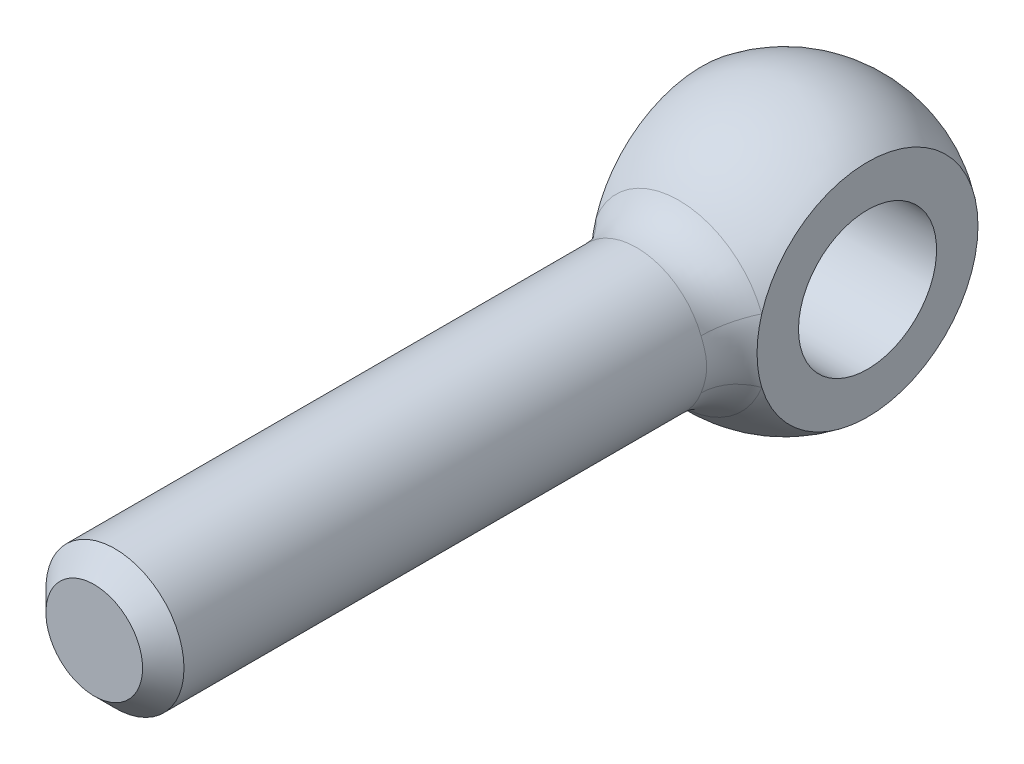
ISO-10303-21;
HEADER;
FILE_DESCRIPTION(('STEP AP214'),'2;1');
FILE_NAME('part.step','',(''),(''),'','','');
FILE_SCHEMA(('AUTOMOTIVE_DESIGN { 1 0 10303 214 1 1 1 1 }'));
ENDSEC;
DATA;
#1=APPLICATION_CONTEXT('core data for automotive mechanical design processes');
#2=APPLICATION_PROTOCOL_DEFINITION('international standard','automotive_design',2000,#1);
#3=PRODUCT_CONTEXT('',#1,'mechanical');
#4=PRODUCT('Part','Part','',(#3));
#5=PRODUCT_RELATED_PRODUCT_CATEGORY('part','',(#4));
#6=PRODUCT_DEFINITION_FORMATION('','',#4);
#7=PRODUCT_DEFINITION_CONTEXT('part definition',#1,'design');
#8=PRODUCT_DEFINITION('design','',#6,#7);
#9=PRODUCT_DEFINITION_SHAPE('','',#8);
#10=(LENGTH_UNIT() NAMED_UNIT(*) SI_UNIT(.MILLI.,.METRE.));
#11=(NAMED_UNIT(*) PLANE_ANGLE_UNIT() SI_UNIT($,.RADIAN.));
#12=(NAMED_UNIT(*) SI_UNIT($,.STERADIAN.) SOLID_ANGLE_UNIT());
#13=UNCERTAINTY_MEASURE_WITH_UNIT(LENGTH_MEASURE(1.E-05),#10,'distance_accuracy_value','');
#14=(GEOMETRIC_REPRESENTATION_CONTEXT(3) GLOBAL_UNCERTAINTY_ASSIGNED_CONTEXT((#13)) GLOBAL_UNIT_ASSIGNED_CONTEXT((#10,
#11,#12)) REPRESENTATION_CONTEXT('',''));
#15=CARTESIAN_POINT('',(0.,0.,0.));
#16=DIRECTION('',(0.,0.,1.));
#17=DIRECTION('',(1.,0.,0.));
#18=AXIS2_PLACEMENT_3D('',#15,#16,#17);
#19=CARTESIAN_POINT('',(0.,0.,0.));
#20=DIRECTION('',(-1.,0.,0.));
#21=DIRECTION('',(0.,0.,-1.));
#22=AXIS2_PLACEMENT_3D('',#19,#20,#21);
#23=SPHERICAL_SURFACE('',#22,10.);
#24=CARTESIAN_POINT('',(6.,0.,0.));
#25=DIRECTION('',(1.,0.,0.));
#26=DIRECTION('',(0.,0.,1.));
#27=AXIS2_PLACEMENT_3D('',#24,#25,#26);
#28=CIRCLE('',#27,8.);
#29=CARTESIAN_POINT('',(6.,2.30792777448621,7.65986092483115));
#30=VERTEX_POINT('',#29);
#31=CARTESIAN_POINT('',(6.,-2.30792777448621,7.65986092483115));
#32=VERTEX_POINT('',#31);
#33=EDGE_CURVE('E64',#30,#32,#28,.F.);
#34=ORIENTED_EDGE('',*,*,#33,.T.);
#35=CARTESIAN_POINT('',(0.,0.,7.65986092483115));
#36=DIRECTION('',(0.,0.,-1.));
#37=DIRECTION('',(-1.,0.,0.));
#38=AXIS2_PLACEMENT_3D('',#35,#36,#37);
#39=CIRCLE('',#38,6.42857142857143);
#40=CARTESIAN_POINT('',(-6.,-2.30792777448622,7.65986092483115));
#41=VERTEX_POINT('',#40);
#42=EDGE_CURVE('E72',#32,#41,#39,.T.);
#43=ORIENTED_EDGE('',*,*,#42,.T.);
#44=CARTESIAN_POINT('',(-6.,0.,0.));
#45=DIRECTION('',(1.,0.,0.));
#46=DIRECTION('',(0.,0.,1.));
#47=AXIS2_PLACEMENT_3D('',#44,#45,#46);
#48=CIRCLE('',#47,8.);
#49=CARTESIAN_POINT('',(-6.,2.30792777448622,7.65986092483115));
#50=VERTEX_POINT('',#49);
#51=EDGE_CURVE('E60',#50,#41,#48,.F.);
#52=ORIENTED_EDGE('',*,*,#51,.F.);
#53=CARTESIAN_POINT('',(0.,0.,7.65986092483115));
#54=DIRECTION('',(0.,0.,-1.));
#55=DIRECTION('',(-1.,0.,0.));
#56=AXIS2_PLACEMENT_3D('',#53,#54,#55);
#57=CIRCLE('',#56,6.42857142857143);
#58=EDGE_CURVE('E69',#50,#30,#57,.T.);
#59=ORIENTED_EDGE('',*,*,#58,.T.);
#60=EDGE_LOOP('',(#34,#43,#52,#59));
#61=FACE_BOUND('',#60,.T.);
#62=ADVANCED_FACE('F14',(#61),#23,.T.);
#63=CARTESIAN_POINT('',(0.,0.,-10.));
#64=DIRECTION('',(0.,0.,-1.));
#65=DIRECTION('',(1.,0.,0.));
#66=AXIS2_PLACEMENT_3D('',#63,#64,#65);
#67=CYLINDRICAL_SURFACE('',#66,5.);
#68=CARTESIAN_POINT('',(6.,3.2267323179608,7.3203960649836));
#69=CARTESIAN_POINT('',(4.3927793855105,2.40032191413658,8.4981017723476));
#70=CARTESIAN_POINT('',(4.26719928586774,2.60595668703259,10.6417078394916));
#71=CARTESIAN_POINT('',(6.,3.15637994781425,7.35140196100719));
#72=CARTESIAN_POINT('',(4.41396770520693,2.35868794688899,8.53415924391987));
#73=CARTESIAN_POINT('',(4.30636952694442,2.54182050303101,10.6569167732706));
#74=CARTESIAN_POINT('',(6.,3.0845678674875,7.38184900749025));
#75=CARTESIAN_POINT('',(4.43598568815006,2.31489371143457,8.5688842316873));
#76=CARTESIAN_POINT('',(4.34415743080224,2.47668749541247,10.6696741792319));
#77=CARTESIAN_POINT('',(6.,2.93788308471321,7.44144632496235));
#78=CARTESIAN_POINT('',(4.48100668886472,2.22296783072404,8.63529633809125));
#79=CARTESIAN_POINT('',(4.41682149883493,2.34464512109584,10.6908098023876));
#80=CARTESIAN_POINT('',(6.,2.86301195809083,7.4705972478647));
#81=CARTESIAN_POINT('',(4.50400416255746,2.1748602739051,8.6669999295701));
#82=CARTESIAN_POINT('',(4.45169913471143,2.27773667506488,10.699190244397));
#83=CARTESIAN_POINT('',(6.,2.63359256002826,7.55584558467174));
#84=CARTESIAN_POINT('',(4.5734661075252,2.02411950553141,8.75712422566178));
#85=CARTESIAN_POINT('',(4.55175884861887,2.07466593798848,10.7185614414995));
#86=CARTESIAN_POINT('',(6.,2.47414356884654,7.60978095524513));
#87=CARTESIAN_POINT('',(4.62076994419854,1.91438028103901,8.8111571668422));
#88=CARTESIAN_POINT('',(4.61242106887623,1.9360709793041,10.7238012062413));
#89=CARTESIAN_POINT('',(6.,2.15560728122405,7.70575431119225));
#90=CARTESIAN_POINT('',(4.70836207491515,1.68665244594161,8.90207343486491));
#91=CARTESIAN_POINT('',(4.71637744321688,1.66582754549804,10.7238090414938));
#92=CARTESIAN_POINT('',(6.,1.99760407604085,7.74840995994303));
#93=CARTESIAN_POINT('',(4.7489352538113,1.57023745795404,8.94011459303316));
#94=CARTESIAN_POINT('',(4.76069958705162,1.53456694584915,10.7194159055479));
#95=CARTESIAN_POINT('',(6.,1.67034421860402,7.82548342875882));
#96=CARTESIAN_POINT('',(4.82366839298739,1.32353889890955,9.00539080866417));
#97=CARTESIAN_POINT('',(4.83830988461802,1.26882691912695,10.7060668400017));
#98=CARTESIAN_POINT('',(6.,1.50108215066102,7.85989724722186));
#99=CARTESIAN_POINT('',(4.85792118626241,1.19318069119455,9.03274138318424));
#100=CARTESIAN_POINT('',(4.87159268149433,1.13434596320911,10.6971087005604));
#101=CARTESIAN_POINT('',(6.,1.15262565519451,7.91850047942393));
#102=CARTESIAN_POINT('',(4.91671483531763,0.921194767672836,9.07731285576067));
#103=CARTESIAN_POINT('',(4.92691418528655,0.862968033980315,10.6789999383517));
#104=CARTESIAN_POINT('',(6.,0.97342214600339,7.94268036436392));
#105=CARTESIAN_POINT('',(4.94135412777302,0.779366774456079,9.09462093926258));
#106=CARTESIAN_POINT('',(4.94894241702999,0.726068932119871,10.6698491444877));
#107=CARTESIAN_POINT('',(6.,0.608286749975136,7.97894634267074));
#108=CARTESIAN_POINT('',(4.97835060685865,0.488614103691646,9.11990305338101));
#109=CARTESIAN_POINT('',(4.98155564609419,0.450879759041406,10.6552429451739));
#110=CARTESIAN_POINT('',(6.,0.42235660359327,7.9910355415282));
#111=CARTESIAN_POINT('',(4.99079415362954,0.339389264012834,9.12793953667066));
#112=CARTESIAN_POINT('',(4.99214358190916,0.312590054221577,10.6497865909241));
#113=CARTESIAN_POINT('',(6.,0.0470401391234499,8.0020775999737));
#114=CARTESIAN_POINT('',(5.00212876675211,0.037959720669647,9.13527953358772));
#115=CARTESIAN_POINT('',(5.0018265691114,0.0346295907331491,10.6448278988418));
#116=CARTESIAN_POINT('',(6.,-0.142361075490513,8.0009406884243));
#117=CARTESIAN_POINT('',(5.00095572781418,-0.114635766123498,9.13454178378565));
#118=CARTESIAN_POINT('',(5.00084307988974,-0.105044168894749,10.6453662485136));
#119=CARTESIAN_POINT('',(6.,-0.51810128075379,7.98542192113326));
#120=CARTESIAN_POINT('',(4.98503390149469,-0.416175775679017,9.12417872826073));
#121=CARTESIAN_POINT('',(4.98720206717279,-0.383785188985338,10.652268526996));
#122=CARTESIAN_POINT('',(6.,-0.704439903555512,7.97103848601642));
#123=CARTESIAN_POINT('',(4.9702437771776,-0.565490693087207,9.11452643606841));
#124=CARTESIAN_POINT('',(4.97454315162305,-0.522852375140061,10.6586331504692));
#125=CARTESIAN_POINT('',(6.,-1.06953275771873,7.93031431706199));
#126=CARTESIAN_POINT('',(4.92878330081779,-0.855453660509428,9.08576459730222));
#127=CARTESIAN_POINT('',(4.93766171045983,-0.799340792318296,10.6744961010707));
#128=CARTESIAN_POINT('',(6.,-1.24828908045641,7.9039769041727));
#129=CARTESIAN_POINT('',(4.90202436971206,-0.996394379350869,9.06658927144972));
#130=CARTESIAN_POINT('',(4.91344239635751,-0.936762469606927,10.6839935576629));
#131=CARTESIAN_POINT('',(6.,-1.59553264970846,7.84126612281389));
#132=CARTESIAN_POINT('',(4.83940307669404,-1.26604567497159,9.01799514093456));
#133=CARTESIAN_POINT('',(4.85359923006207,-1.20914010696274,10.7020036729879));
#134=CARTESIAN_POINT('',(6.,-1.76401866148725,7.80489155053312));
#135=CARTESIAN_POINT('',(4.80342965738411,-1.39492473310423,8.98847100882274));
#136=CARTESIAN_POINT('',(4.81797400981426,-1.34409576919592,10.7105162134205));
#137=CARTESIAN_POINT('',(6.,-2.08964080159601,7.72409131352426));
#138=CARTESIAN_POINT('',(4.72580117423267,-1.63827852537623,8.91856014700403));
#139=CARTESIAN_POINT('',(4.7355062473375,-1.61073332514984,10.7220684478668));
#140=CARTESIAN_POINT('',(6.,-2.24676902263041,7.67966011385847));
#141=CARTESIAN_POINT('',(4.68404997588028,-1.75278971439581,8.87803959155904));
#142=CARTESIAN_POINT('',(4.68865598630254,-1.74241289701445,10.7251043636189));
#143=CARTESIAN_POINT('',(6.,-2.54938213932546,7.5845769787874));
#144=CARTESIAN_POINT('',(4.59869902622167,-1.96626185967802,8.78604728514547));
#145=CARTESIAN_POINT('',(4.58413287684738,-2.001300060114,10.7214381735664));
#146=CARTESIAN_POINT('',(6.,-2.69487333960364,7.53392844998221));
#147=CARTESIAN_POINT('',(4.55505237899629,-2.06517695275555,8.73445253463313));
#148=CARTESIAN_POINT('',(4.52646594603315,-2.1285100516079,10.7147413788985));
#149=CARTESIAN_POINT('',(6.,-2.97563340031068,7.42753384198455));
#150=CARTESIAN_POINT('',(4.46945882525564,-2.24823791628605,8.62043143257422));
#151=CARTESIAN_POINT('',(4.40053898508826,-2.37799449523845,10.6877579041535));
#152=CARTESIAN_POINT('',(6.,-3.11084689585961,7.37176329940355));
#153=CARTESIAN_POINT('',(4.42753255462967,-2.33217907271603,8.55784369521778));
#154=CARTESIAN_POINT('',(4.3322269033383,-2.50024076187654,10.6674027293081));
#155=CARTESIAN_POINT('',(6.,-3.30618612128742,7.28520546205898));
#156=CARTESIAN_POINT('',(4.36877466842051,-2.44740194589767,8.4568984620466));
#157=CARTESIAN_POINT('',(4.22266455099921,-2.6784309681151,10.6241540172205));
#158=CARTESIAN_POINT('',(6.,-3.37012775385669,7.25583055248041));
#159=CARTESIAN_POINT('',(4.34979966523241,-2.48417205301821,8.42189416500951));
#160=CARTESIAN_POINT('',(4.18490963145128,-2.73703466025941,10.6075896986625));
#161=CARTESIAN_POINT('',(6.,-3.49564302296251,7.19620015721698));
#162=CARTESIAN_POINT('',(4.31353045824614,-2.55449740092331,8.34959125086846));
#163=CARTESIAN_POINT('',(4.10720301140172,-2.85231842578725,10.5698584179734));
#164=CARTESIAN_POINT('',(6.,-3.55721601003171,7.16594443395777));
#165=CARTESIAN_POINT('',(4.29624676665,-2.58803247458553,8.31228600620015));
#166=CARTESIAN_POINT('',(4.06725071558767,-2.90899797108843,10.5486902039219));
#167=CARTESIAN_POINT('',(6.,-3.61768386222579,7.13529000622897));
#168=CARTESIAN_POINT('',(4.28001098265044,-2.62004266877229,8.27400289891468));
#169=CARTESIAN_POINT('',(4.02628463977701,-2.96463016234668,10.5250470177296));
#170=(BOUNDED_SURFACE() B_SPLINE_SURFACE(3,2,((#68,#69,#70),(#71,#72,#73),(#74,#75,#76),(#77,
#78,#79),(#80,#81,#82),(#83,#84,#85),(#86,#87,#88),(#89,#90,#91),(#92,#93,#94),(#95,#96,#97),
(#98,#99,#100),(#101,#102,#103),(#104,#105,#106),(#107,#108,#109),(#110,#111,#112),(#113,#114,
#115),(#116,#117,#118),(#119,#120,#121),(#122,#123,#124),(#125,#126,#127),(#128,#129,#130),
(#131,#132,#133),(#134,#135,#136),(#137,#138,#139),(#140,#141,#142),(#143,#144,#145),(#146,#147,
#148),(#149,#150,#151),(#152,#153,#154),(#155,#156,#157),(#158,#159,#160),(#161,#162,#163),
(#164,#165,#166),(#167,#168,#169)),.UNSPECIFIED.,.F.,.F.,.F.) B_SPLINE_SURFACE_WITH_KNOTS((4,2,
2,2,2,2,2,2,2,2,2,2,2,2,2,2,4),(3,3),(0.,0.408247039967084,0.816286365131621,1.63181270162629,
2.37916270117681,3.12687482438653,3.87528161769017,4.62349613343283,5.37679204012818,
6.13017777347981,6.88335433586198,7.63662127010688,8.39040767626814,9.14378289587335,
9.90096470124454,10.2805077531,10.6601541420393),(0.,1.),
.UNSPECIFIED.) GEOMETRIC_REPRESENTATION_ITEM() RATIONAL_B_SPLINE_SURFACE(((1.,0.880171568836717,
1.),(1.,0.8823764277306,1.),(1.,0.884598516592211,1.),(1.,0.889041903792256,1.),(1.,
0.891263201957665,1.),(1.,0.897873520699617,1.),(1.,0.902212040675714,1.),(1.,0.910097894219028,
1.),(1.,0.913681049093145,1.),(1.,0.920229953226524,1.),(1.,0.923195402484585,1.),(1.,
0.928274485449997,1.),(1.,0.93038732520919,1.),(1.,0.933563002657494,1.),(1.,0.934626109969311,
1.),(1.,0.935596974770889,1.),(1.,0.935496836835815,1.),(1.,0.934132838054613,1.),(1.,
0.932868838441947,1.),(1.,0.929307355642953,1.),(1.,0.927010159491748,1.),(1.,0.921590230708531,
1.),(1.,0.918467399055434,1.),(1.,0.911637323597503,1.),(1.,0.907929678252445,1.),(1.,
0.90018481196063,1.),(1.,0.89614777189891,1.),(1.,0.88796108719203,1.),(1.,0.883810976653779,
1.),(1.,0.877676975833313,1.),(1.,0.875645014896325,1.),(1.,0.871634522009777,1.),(1.,
0.8696560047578,1.),(1.,0.867715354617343,1.))) REPRESENTATION_ITEM('') SURFACE());
#171=CARTESIAN_POINT('',(4.02628463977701,-2.96463016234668,10.5250470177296));
#172=CARTESIAN_POINT('',(4.06725071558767,-2.90899797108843,10.5486902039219));
#173=CARTESIAN_POINT('',(4.10720301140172,-2.85231842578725,10.5698584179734));
#174=CARTESIAN_POINT('',(4.18490963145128,-2.73703466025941,10.6075896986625));
#175=CARTESIAN_POINT('',(4.22266455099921,-2.6784309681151,10.6241540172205));
#176=CARTESIAN_POINT('',(4.3322269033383,-2.50024076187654,10.6674027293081));
#177=CARTESIAN_POINT('',(4.40053898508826,-2.37799449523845,10.6877579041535));
#178=CARTESIAN_POINT('',(4.52646594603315,-2.1285100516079,10.7147413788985));
#179=CARTESIAN_POINT('',(4.58413287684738,-2.001300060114,10.7214381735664));
#180=CARTESIAN_POINT('',(4.68865598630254,-1.74241289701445,10.7251043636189));
#181=CARTESIAN_POINT('',(4.7355062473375,-1.61073332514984,10.7220684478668));
#182=CARTESIAN_POINT('',(4.81797400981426,-1.34409576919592,10.7105162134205));
#183=CARTESIAN_POINT('',(4.85359923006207,-1.20914010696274,10.7020036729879));
#184=CARTESIAN_POINT('',(4.91344239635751,-0.936762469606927,10.6839935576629));
#185=CARTESIAN_POINT('',(4.93766171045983,-0.799340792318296,10.6744961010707));
#186=CARTESIAN_POINT('',(4.97454315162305,-0.522852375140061,10.6586331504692));
#187=CARTESIAN_POINT('',(4.98720206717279,-0.383785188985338,10.652268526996));
#188=CARTESIAN_POINT('',(5.00084307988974,-0.105044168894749,10.6453662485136));
#189=CARTESIAN_POINT('',(5.0018265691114,0.0346295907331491,10.6448278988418));
#190=CARTESIAN_POINT('',(4.99214358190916,0.312590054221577,10.6497865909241));
#191=CARTESIAN_POINT('',(4.98155564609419,0.450879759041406,10.6552429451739));
#192=CARTESIAN_POINT('',(4.94894241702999,0.726068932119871,10.6698491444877));
#193=CARTESIAN_POINT('',(4.92691418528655,0.862968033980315,10.6789999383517));
#194=CARTESIAN_POINT('',(4.87159268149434,1.13434596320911,10.6971087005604));
#195=CARTESIAN_POINT('',(4.83830988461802,1.26882691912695,10.7060668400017));
#196=CARTESIAN_POINT('',(4.76069958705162,1.53456694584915,10.7194159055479));
#197=CARTESIAN_POINT('',(4.71637744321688,1.66582754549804,10.7238090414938));
#198=CARTESIAN_POINT('',(4.61242106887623,1.9360709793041,10.7238012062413));
#199=CARTESIAN_POINT('',(4.55175884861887,2.07466593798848,10.7185614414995));
#200=CARTESIAN_POINT('',(4.45169913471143,2.27773667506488,10.699190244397));
#201=CARTESIAN_POINT('',(4.41682149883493,2.34464512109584,10.6908098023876));
#202=CARTESIAN_POINT('',(4.34415743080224,2.47668749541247,10.6696741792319));
#203=CARTESIAN_POINT('',(4.30636952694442,2.54182050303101,10.6569167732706));
#204=CARTESIAN_POINT('',(4.26719928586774,2.60595668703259,10.6417078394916));
#205=B_SPLINE_CURVE_WITH_KNOTS('',3,(#171,#172,#173,#174,#175,#176,#177,#178,#179,#180,#181,
#182,#183,#184,#185,#186,#187,#188,#189,#190,#191,#192,#193,#194,#195,#196,#197,#198,#199,#200,
#201,#202,#203,#204),.UNSPECIFIED.,.F.,.F.,(4,2,2,2,2,2,2,2,2,2,2,2,2,2,2,2,4),(0.,
0.379646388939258,0.759189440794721,1.51637124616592,2.26974646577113,3.02353287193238,
3.77679980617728,4.52997636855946,5.28336210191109,6.03665800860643,6.7848725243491,
7.53327931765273,8.28099144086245,9.02834144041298,9.84386777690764,10.2519071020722,
10.6601541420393),.UNSPECIFIED.);
#206=CARTESIAN_POINT('',(4.66666666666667,-1.7950549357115,10.7238052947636));
#207=VERTEX_POINT('',#206);
#208=CARTESIAN_POINT('',(4.66666666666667,1.7950549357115,10.7238052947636));
#209=VERTEX_POINT('',#208);
#210=EDGE_CURVE('E87',#207,#209,#205,.T.);
#211=ORIENTED_EDGE('',*,*,#210,.T.);
#212=CARTESIAN_POINT('',(0.,0.,10.7238052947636));
#213=DIRECTION('',(0.,0.,-1.));
#214=DIRECTION('',(-1.,0.,0.));
#215=AXIS2_PLACEMENT_3D('',#212,#213,#214);
#216=CIRCLE('',#215,5.);
#217=CARTESIAN_POINT('',(-4.66666666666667,1.79505493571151,10.7238052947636));
#218=VERTEX_POINT('',#217);
#219=EDGE_CURVE('E9',#209,#218,#216,.F.);
#220=ORIENTED_EDGE('',*,*,#219,.T.);
#221=CARTESIAN_POINT('',(-6.,-3.2267323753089,7.32039603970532));
#222=CARTESIAN_POINT('',(-4.39277936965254,-2.40032194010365,8.49810174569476));
#223=CARTESIAN_POINT('',(-4.26719928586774,-2.60595668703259,10.6417078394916));
#224=CARTESIAN_POINT('',(-6.,-3.15637996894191,7.35140195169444));
#225=CARTESIAN_POINT('',(-4.41396769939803,-2.35868795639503,8.53415923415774));
#226=CARTESIAN_POINT('',(-4.30636952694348,-2.54182050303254,10.6569167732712));
#227=CARTESIAN_POINT('',(-6.,-3.08456787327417,7.38184900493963));
#228=CARTESIAN_POINT('',(-4.43598568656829,-2.31489371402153,8.5688842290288));
#229=CARTESIAN_POINT('',(-4.34415743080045,-2.47668749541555,10.6696741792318));
#230=CARTESIAN_POINT('',(-6.,-2.93788307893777,7.4414463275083));
#231=CARTESIAN_POINT('',(-4.48100669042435,-2.22296782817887,8.63529634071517));
#232=CARTESIAN_POINT('',(-4.41682149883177,-2.34464512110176,10.6908098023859));
#233=CARTESIAN_POINT('',(-6.,-2.86301195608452,7.47059724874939));
#234=CARTESIAN_POINT('',(-4.50400416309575,-2.17486027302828,8.66699993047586));
#235=CARTESIAN_POINT('',(-4.45169913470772,-2.27773667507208,10.6991902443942));
#236=CARTESIAN_POINT('',(-6.,-2.63359256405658,7.55584558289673));
#237=CARTESIAN_POINT('',(-4.57346610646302,-2.02411950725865,8.75712422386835));
#238=CARTESIAN_POINT('',(-4.55175884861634,-2.07466593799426,10.7185614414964));
#239=CARTESIAN_POINT('',(-6.,-2.47414356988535,7.60978095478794));
#240=CARTESIAN_POINT('',(-4.62076994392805,-1.91438028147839,8.81115716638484));
#241=CARTESIAN_POINT('',(-4.6124210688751,-1.93607097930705,10.7238012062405));
#242=CARTESIAN_POINT('',(-6.,-2.15560728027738,7.70575431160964));
#243=CARTESIAN_POINT('',(-4.70836207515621,-1.68665244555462,8.9020734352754));
#244=CARTESIAN_POINT('',(-4.71637744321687,-1.66582754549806,10.7238090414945));
#245=CARTESIAN_POINT('',(-6.,-1.99760407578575,7.74840996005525));
#246=CARTESIAN_POINT('',(-4.74893525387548,-1.57023745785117,8.94011459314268));
#247=CARTESIAN_POINT('',(-4.76069958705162,-1.53456694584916,10.7194159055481));
#248=CARTESIAN_POINT('',(-6.,-1.67034421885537,7.82548342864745));
#249=CARTESIAN_POINT('',(-4.82366839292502,-1.3235388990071,9.00539080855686));
#250=CARTESIAN_POINT('',(-4.83830988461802,-1.26882691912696,10.7060668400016));
#251=CARTESIAN_POINT('',(-6.,-1.50108215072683,7.85989724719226));
#252=CARTESIAN_POINT('',(-4.85792118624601,-1.19318069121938,9.03274138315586));
#253=CARTESIAN_POINT('',(-4.87159268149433,-1.13434596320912,10.6971087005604));
#254=CARTESIAN_POINT('',(-6.,-1.15262565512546,7.91850047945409));
#255=CARTESIAN_POINT('',(-4.91671483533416,-0.921194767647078,9.07731285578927));
#256=CARTESIAN_POINT('',(-4.92691418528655,-0.862968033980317,10.6789999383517));
#257=CARTESIAN_POINT('',(-6.,-0.973422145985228,7.942680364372));
#258=CARTESIAN_POINT('',(-4.94135412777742,-0.779366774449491,9.09462093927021));
#259=CARTESIAN_POINT('',(-4.94894241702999,-0.726068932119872,10.6698491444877));
#260=CARTESIAN_POINT('',(-6.,-0.608286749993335,7.97894634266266));
#261=CARTESIAN_POINT('',(-4.97835060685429,-0.488614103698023,9.11990305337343));
#262=CARTESIAN_POINT('',(-4.98155564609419,-0.450879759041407,10.6552429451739));
#263=CARTESIAN_POINT('',(-6.,-0.422356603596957,7.99103554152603));
#264=CARTESIAN_POINT('',(-4.99079415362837,-0.339389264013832,9.12793953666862));
#265=CARTESIAN_POINT('',(-4.99214358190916,-0.312590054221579,10.6497865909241));
#266=CARTESIAN_POINT('',(-6.,-0.047040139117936,8.00207759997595));
#267=CARTESIAN_POINT('',(-5.00212876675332,-0.0379597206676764,9.13527953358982));
#268=CARTESIAN_POINT('',(-5.0018265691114,-0.0346295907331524,10.6448278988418));
#269=CARTESIAN_POINT('',(-6.,0.142361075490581,8.00094068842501));
#270=CARTESIAN_POINT('',(-5.00095572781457,0.11463576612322,9.1345417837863));
#271=CARTESIAN_POINT('',(-5.00084307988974,0.105044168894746,10.6453662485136));
#272=CARTESIAN_POINT('',(-6.,0.518101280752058,7.98542192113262));
#273=CARTESIAN_POINT('',(-4.98503390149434,0.41617577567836,9.12417872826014));
#274=CARTESIAN_POINT('',(-4.9872020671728,0.383785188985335,10.652268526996));
#275=CARTESIAN_POINT('',(-6.,0.704439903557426,7.97103848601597));
#276=CARTESIAN_POINT('',(-4.97024377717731,0.565490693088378,9.11452643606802));
#277=CARTESIAN_POINT('',(-4.97454315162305,0.522852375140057,10.6586331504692));
#278=CARTESIAN_POINT('',(-6.,1.06953275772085,7.93031431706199));
#279=CARTESIAN_POINT('',(-4.92878330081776,0.85545366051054,9.08576459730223));
#280=CARTESIAN_POINT('',(-4.93766171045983,0.799340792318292,10.6744961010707));
#281=CARTESIAN_POINT('',(-6.,1.2482890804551,7.90397690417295));
#282=CARTESIAN_POINT('',(-4.90202436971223,0.996394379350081,9.06658927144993));
#283=CARTESIAN_POINT('',(-4.91344239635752,0.936762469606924,10.6839935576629));
#284=CARTESIAN_POINT('',(-6.,1.59553264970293,7.84126612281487));
#285=CARTESIAN_POINT('',(-4.83940307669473,1.26604567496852,9.01799514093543));
#286=CARTESIAN_POINT('',(-4.85359923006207,1.20914010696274,10.7020036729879));
#287=CARTESIAN_POINT('',(-6.,1.76401866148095,7.80489155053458));
#288=CARTESIAN_POINT('',(-4.80342965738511,1.39492473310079,8.98847100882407));
#289=CARTESIAN_POINT('',(-4.81797400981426,1.34409576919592,10.7105162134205));
#290=CARTESIAN_POINT('',(-6.,2.08964080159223,7.72409131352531));
#291=CARTESIAN_POINT('',(-4.72580117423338,1.63827852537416,8.918560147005));
#292=CARTESIAN_POINT('',(-4.7355062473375,1.61073332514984,10.7220684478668));
#293=CARTESIAN_POINT('',(-6.,2.24676902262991,7.67966011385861));
#294=CARTESIAN_POINT('',(-4.68404997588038,1.75278971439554,8.87803959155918));
#295=CARTESIAN_POINT('',(-4.68865598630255,1.74241289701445,10.7251043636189));
#296=CARTESIAN_POINT('',(-6.,2.54938213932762,7.58457697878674));
#297=CARTESIAN_POINT('',(-4.59869902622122,1.96626185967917,8.78604728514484));
#298=CARTESIAN_POINT('',(-4.58413287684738,2.00130006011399,10.7214381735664));
#299=CARTESIAN_POINT('',(-6.,2.69487333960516,7.53392844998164));
#300=CARTESIAN_POINT('',(-4.55505237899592,2.06517695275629,8.73445253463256));
#301=CARTESIAN_POINT('',(-4.52646594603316,2.12851005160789,10.7147413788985));
#302=CARTESIAN_POINT('',(-6.,2.97563340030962,7.42753384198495));
#303=CARTESIAN_POINT('',(-4.4694588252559,2.24823791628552,8.62043143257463));
#304=CARTESIAN_POINT('',(-4.40053898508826,2.37799449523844,10.6877579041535));
#305=CARTESIAN_POINT('',(-6.,3.11084689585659,7.37176329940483));
#306=CARTESIAN_POINT('',(-4.42753255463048,2.33217907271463,8.55784369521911));
#307=CARTESIAN_POINT('',(-4.33222690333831,2.50024076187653,10.6674027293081));
#308=CARTESIAN_POINT('',(-6.,3.30618612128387,7.28520546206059));
#309=CARTESIAN_POINT('',(-4.3687746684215,2.44740194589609,8.45689846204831));
#310=CARTESIAN_POINT('',(-4.22266455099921,2.67843096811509,10.6241540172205));
#311=CARTESIAN_POINT('',(-6.,3.37012775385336,7.25583055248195));
#312=CARTESIAN_POINT('',(-4.34979966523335,2.48417205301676,8.42189416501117));
#313=CARTESIAN_POINT('',(-4.18490963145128,2.73703466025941,10.6075896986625));
#314=CARTESIAN_POINT('',(-6.,3.4956430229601,7.19620015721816));
#315=CARTESIAN_POINT('',(-4.31353045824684,2.55449740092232,8.34959125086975));
#316=CARTESIAN_POINT('',(-4.10720301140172,2.85231842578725,10.5698584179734));
#317=CARTESIAN_POINT('',(-6.,3.55721601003,7.16594443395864));
#318=CARTESIAN_POINT('',(-4.2962467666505,2.58803247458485,8.3122860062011));
#319=CARTESIAN_POINT('',(-4.06725071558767,2.90899797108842,10.5486902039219));
#320=CARTESIAN_POINT('',(-6.,3.61768386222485,7.13529000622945));
#321=CARTESIAN_POINT('',(-4.28001098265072,2.62004266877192,8.27400289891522));
#322=CARTESIAN_POINT('',(-4.02628463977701,2.96463016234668,10.5250470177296));
#323=(BOUNDED_SURFACE() B_SPLINE_SURFACE(3,2,((#221,#222,#223),(#224,#225,#226),(#227,#228,
#229),(#230,#231,#232),(#233,#234,#235),(#236,#237,#238),(#239,#240,#241),(#242,#243,#244),
(#245,#246,#247),(#248,#249,#250),(#251,#252,#253),(#254,#255,#256),(#257,#258,#259),(#260,#261,
#262),(#263,#264,#265),(#266,#267,#268),(#269,#270,#271),(#272,#273,#274),(#275,#276,#277),
(#278,#279,#280),(#281,#282,#283),(#284,#285,#286),(#287,#288,#289),(#290,#291,#292),(#293,#294,
#295),(#296,#297,#298),(#299,#300,#301),(#302,#303,#304),(#305,#306,#307),(#308,#309,#310),
(#311,#312,#313),(#314,#315,#316),(#317,#318,#319),(#320,#321,#322)),.UNSPECIFIED.,.F.,.F.,
.F.) B_SPLINE_SURFACE_WITH_KNOTS((4,2,2,2,2,2,2,2,2,2,2,2,2,2,2,2,4),(3,3),(0.,
0.408247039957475,0.816286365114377,1.63181270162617,2.37916270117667,3.12687482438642,
3.87528161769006,4.62349613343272,5.37679204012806,6.13017777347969,6.88335433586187,
7.63662127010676,8.39040767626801,9.14378289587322,9.90096470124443,10.2805077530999,
10.6601541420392),(0.,1.),
.UNSPECIFIED.) GEOMETRIC_REPRESENTATION_ITEM() RATIONAL_B_SPLINE_SURFACE(((1.,0.880171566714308,
1.),(1.,0.882376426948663,1.),(1.,0.884598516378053,1.),(1.,0.88904190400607,1.),(1.,
0.89126320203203,1.),(1.,0.897873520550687,1.),(1.,0.902212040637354,1.),(1.,0.910097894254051,
1.),(1.,0.913681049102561,1.),(1.,0.920229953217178,1.),(1.,0.9231954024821,1.),(1.,
0.928274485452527,1.),(1.,0.930387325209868,1.),(1.,0.933563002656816,1.),(1.,0.934626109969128,
1.),(1.,0.935596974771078,1.),(1.,0.935496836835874,1.),(1.,0.93413283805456,1.),(1.,
0.93286883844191,1.),(1.,0.929307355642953,1.),(1.,0.927010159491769,1.),(1.,0.921590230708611,
1.),(1.,0.918467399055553,1.),(1.,0.911637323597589,1.),(1.,0.907929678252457,1.),(1.,
0.900184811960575,1.),(1.,0.896147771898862,1.),(1.,0.887961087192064,1.),(1.,0.883810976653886,
1.),(1.,0.877676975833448,1.),(1.,0.875645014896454,1.),(1.,0.871634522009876,1.),(1.,
0.869656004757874,1.),(1.,0.867715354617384,1.))) REPRESENTATION_ITEM('') SURFACE());
#324=CARTESIAN_POINT('',(-4.02628463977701,2.96463016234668,10.5250470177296));
#325=CARTESIAN_POINT('',(-4.06725071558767,2.90899797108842,10.5486902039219));
#326=CARTESIAN_POINT('',(-4.10720301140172,2.85231842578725,10.5698584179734));
#327=CARTESIAN_POINT('',(-4.18490963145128,2.73703466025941,10.6075896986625));
#328=CARTESIAN_POINT('',(-4.22266455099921,2.67843096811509,10.6241540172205));
#329=CARTESIAN_POINT('',(-4.33222690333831,2.50024076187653,10.6674027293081));
#330=CARTESIAN_POINT('',(-4.40053898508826,2.37799449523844,10.6877579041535));
#331=CARTESIAN_POINT('',(-4.52646594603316,2.12851005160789,10.7147413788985));
#332=CARTESIAN_POINT('',(-4.58413287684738,2.00130006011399,10.7214381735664));
#333=CARTESIAN_POINT('',(-4.68865598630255,1.74241289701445,10.7251043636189));
#334=CARTESIAN_POINT('',(-4.7355062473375,1.61073332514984,10.7220684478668));
#335=CARTESIAN_POINT('',(-4.81797400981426,1.34409576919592,10.7105162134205));
#336=CARTESIAN_POINT('',(-4.85359923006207,1.20914010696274,10.7020036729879));
#337=CARTESIAN_POINT('',(-4.91344239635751,0.936762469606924,10.6839935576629));
#338=CARTESIAN_POINT('',(-4.93766171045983,0.799340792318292,10.6744961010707));
#339=CARTESIAN_POINT('',(-4.97454315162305,0.522852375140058,10.6586331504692));
#340=CARTESIAN_POINT('',(-4.9872020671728,0.383785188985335,10.652268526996));
#341=CARTESIAN_POINT('',(-5.00084307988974,0.105044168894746,10.6453662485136));
#342=CARTESIAN_POINT('',(-5.0018265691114,-0.0346295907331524,10.6448278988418));
#343=CARTESIAN_POINT('',(-4.99214358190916,-0.312590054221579,10.6497865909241));
#344=CARTESIAN_POINT('',(-4.98155564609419,-0.450879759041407,10.6552429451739));
#345=CARTESIAN_POINT('',(-4.94894241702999,-0.726068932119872,10.6698491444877));
#346=CARTESIAN_POINT('',(-4.92691418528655,-0.862968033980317,10.6789999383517));
#347=CARTESIAN_POINT('',(-4.87159268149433,-1.13434596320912,10.6971087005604));
#348=CARTESIAN_POINT('',(-4.83830988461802,-1.26882691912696,10.7060668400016));
#349=CARTESIAN_POINT('',(-4.76069958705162,-1.53456694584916,10.7194159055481));
#350=CARTESIAN_POINT('',(-4.71637744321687,-1.66582754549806,10.7238090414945));
#351=CARTESIAN_POINT('',(-4.6124210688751,-1.93607097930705,10.7238012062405));
#352=CARTESIAN_POINT('',(-4.55175884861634,-2.07466593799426,10.7185614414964));
#353=CARTESIAN_POINT('',(-4.45169913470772,-2.27773667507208,10.6991902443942));
#354=CARTESIAN_POINT('',(-4.41682149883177,-2.34464512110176,10.6908098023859));
#355=CARTESIAN_POINT('',(-4.34415743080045,-2.47668749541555,10.6696741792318));
#356=CARTESIAN_POINT('',(-4.30636952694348,-2.54182050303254,10.6569167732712));
#357=CARTESIAN_POINT('',(-4.26719928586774,-2.60595668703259,10.6417078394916));
#358=B_SPLINE_CURVE_WITH_KNOTS('',3,(#324,#325,#326,#327,#328,#329,#330,#331,#332,#333,#334,
#335,#336,#337,#338,#339,#340,#341,#342,#343,#344,#345,#346,#347,#348,#349,#350,#351,#352,#353,
#354,#355,#356,#357),.UNSPECIFIED.,.F.,.F.,(4,2,2,2,2,2,2,2,2,2,2,2,2,2,2,2,4),(0.,
0.379646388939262,0.759189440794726,1.51637124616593,2.26974646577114,3.02353287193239,
3.77679980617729,4.52997636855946,5.28336210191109,6.03665800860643,6.78487252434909,
7.53327931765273,8.28099144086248,9.02834144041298,9.84386777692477,10.2519071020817,
10.6601541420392),.UNSPECIFIED.);
#359=CARTESIAN_POINT('',(-4.66666666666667,-1.79505493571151,10.7238052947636));
#360=VERTEX_POINT('',#359);
#361=EDGE_CURVE('E27',#218,#360,#358,.T.);
#362=ORIENTED_EDGE('',*,*,#361,.T.);
#363=CARTESIAN_POINT('',(0.,0.,10.7238052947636));
#364=DIRECTION('',(0.,0.,-1.));
#365=DIRECTION('',(-1.,0.,0.));
#366=AXIS2_PLACEMENT_3D('',#363,#364,#365);
#367=CIRCLE('',#366,5.);
#368=EDGE_CURVE('E101',#360,#207,#367,.F.);
#369=ORIENTED_EDGE('',*,*,#368,.T.);
#370=EDGE_LOOP('',(#211,#220,#362,#369));
#371=FACE_BOUND('',#370,.T.);
#372=CARTESIAN_POINT('',(0.,0.,48.5));
#373=DIRECTION('',(0.,0.,-1.));
#374=DIRECTION('',(1.,0.,0.));
#375=AXIS2_PLACEMENT_3D('',#372,#373,#374);
#376=CIRCLE('',#375,5.);
#377=CARTESIAN_POINT('',(5.,0.,48.5));
#378=VERTEX_POINT('',#377);
#379=EDGE_CURVE('E85',#378,#378,#376,.T.);
#380=ORIENTED_EDGE('',*,*,#379,.T.);
#381=EDGE_LOOP('',(#380));
#382=FACE_BOUND('',#381,.T.);
#383=ADVANCED_FACE('F107',(#371,#382),#67,.T.);
#384=CARTESIAN_POINT('',(0.,0.,50.));
#385=DIRECTION('',(0.,0.,-1.));
#386=DIRECTION('',(1.,0.,0.));
#387=AXIS2_PLACEMENT_3D('',#384,#385,#386);
#388=CONICAL_SURFACE('',#387,3.5,0.785398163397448);
#389=ORIENTED_EDGE('',*,*,#379,.F.);
#390=EDGE_LOOP('',(#389));
#391=FACE_BOUND('',#390,.T.);
#392=CARTESIAN_POINT('',(0.,0.,50.));
#393=DIRECTION('',(0.,0.,-1.));
#394=DIRECTION('',(1.,0.,0.));
#395=AXIS2_PLACEMENT_3D('',#392,#393,#394);
#396=CIRCLE('',#395,3.5);
#397=CARTESIAN_POINT('',(3.5,0.,50.));
#398=VERTEX_POINT('',#397);
#399=EDGE_CURVE('E73',#398,#398,#396,.T.);
#400=ORIENTED_EDGE('',*,*,#399,.T.);
#401=EDGE_LOOP('',(#400));
#402=FACE_BOUND('',#401,.T.);
#403=ADVANCED_FACE('F111',(#391,#402),#388,.T.);
#404=CARTESIAN_POINT('',(0.,-3.5,50.));
#405=DIRECTION('',(0.,0.,1.));
#406=DIRECTION('',(-1.,0.,0.));
#407=AXIS2_PLACEMENT_3D('',#404,#405,#406);
#408=PLANE('',#407);
#409=ORIENTED_EDGE('',*,*,#399,.F.);
#410=EDGE_LOOP('',(#409));
#411=FACE_BOUND('',#410,.T.);
#412=ADVANCED_FACE('F158',(#411),#408,.T.);
#413=CARTESIAN_POINT('',(-6.,15.,-10.));
#414=DIRECTION('',(1.,0.,0.));
#415=DIRECTION('',(0.,0.,1.));
#416=AXIS2_PLACEMENT_3D('',#413,#414,#415);
#417=PLANE('',#416);
#418=CARTESIAN_POINT('',(-6.,0.,0.));
#419=DIRECTION('',(1.,0.,0.));
#420=DIRECTION('',(0.,0.,1.));
#421=AXIS2_PLACEMENT_3D('',#418,#419,#420);
#422=CIRCLE('',#421,5.);
#423=CARTESIAN_POINT('',(-6.,0.,5.));
#424=VERTEX_POINT('',#423);
#425=EDGE_CURVE('E253',#424,#424,#422,.T.);
#426=ORIENTED_EDGE('',*,*,#425,.T.);
#427=EDGE_LOOP('',(#426));
#428=FACE_BOUND('',#427,.T.);
#429=ORIENTED_EDGE('',*,*,#51,.T.);
#430=EDGE_CURVE('E57',#41,#50,#48,.F.);
#431=ORIENTED_EDGE('',*,*,#430,.T.);
#432=EDGE_LOOP('',(#429,#431));
#433=FACE_BOUND('',#432,.T.);
#434=ADVANCED_FACE('F59',(#428,#433),#417,.F.);
#435=CARTESIAN_POINT('',(6.,15.,-10.));
#436=DIRECTION('',(1.,0.,0.));
#437=DIRECTION('',(0.,0.,1.));
#438=AXIS2_PLACEMENT_3D('',#435,#436,#437);
#439=PLANE('',#438);
#440=CARTESIAN_POINT('',(6.,0.,0.));
#441=DIRECTION('',(1.,0.,0.));
#442=DIRECTION('',(0.,0.,1.));
#443=AXIS2_PLACEMENT_3D('',#440,#441,#442);
#444=CIRCLE('',#443,5.);
#445=CARTESIAN_POINT('',(6.,0.,5.));
#446=VERTEX_POINT('',#445);
#447=EDGE_CURVE('E78',#446,#446,#444,.T.);
#448=ORIENTED_EDGE('',*,*,#447,.F.);
#449=EDGE_LOOP('',(#448));
#450=FACE_BOUND('',#449,.T.);
#451=ORIENTED_EDGE('',*,*,#33,.F.);
#452=EDGE_CURVE('E249',#32,#30,#28,.F.);
#453=ORIENTED_EDGE('',*,*,#452,.F.);
#454=EDGE_LOOP('',(#451,#453));
#455=FACE_BOUND('',#454,.T.);
#456=ADVANCED_FACE('F151',(#450,#455),#439,.T.);
#457=CARTESIAN_POINT('',(10.,0.,0.));
#458=DIRECTION('',(-1.,0.,0.));
#459=DIRECTION('',(0.,0.,-1.));
#460=AXIS2_PLACEMENT_3D('',#457,#458,#459);
#461=CYLINDRICAL_SURFACE('',#460,5.);
#462=ORIENTED_EDGE('',*,*,#447,.T.);
#463=EDGE_LOOP('',(#462));
#464=FACE_BOUND('',#463,.T.);
#465=ORIENTED_EDGE('',*,*,#425,.F.);
#466=EDGE_LOOP('',(#465));
#467=FACE_BOUND('',#466,.T.);
#468=ADVANCED_FACE('F126',(#464,#467),#461,.F.);
#469=CARTESIAN_POINT('',(-8.4,-3.2310988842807,10.7238052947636));
#470=DIRECTION('',(0.359010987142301,-0.933333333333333,0.));
#471=DIRECTION('',(0.933333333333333,0.359010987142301,0.));
#472=AXIS2_PLACEMENT_3D('',#469,#470,#471);
#473=CIRCLE('',#472,4.);
#474=EDGE_CURVE('E79',#360,#41,#473,.F.);
#475=ORIENTED_EDGE('',*,*,#474,.F.);
#476=ORIENTED_EDGE('',*,*,#361,.F.);
#477=CARTESIAN_POINT('',(-8.4,3.23109888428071,10.7238052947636));
#478=DIRECTION('',(-0.359010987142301,-0.933333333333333,0.));
#479=DIRECTION('',(0.933333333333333,-0.359010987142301,0.));
#480=AXIS2_PLACEMENT_3D('',#477,#478,#479);
#481=CIRCLE('',#480,4.);
#482=EDGE_CURVE('E75',#50,#218,#481,.T.);
#483=ORIENTED_EDGE('',*,*,#482,.F.);
#484=ORIENTED_EDGE('',*,*,#430,.F.);
#485=EDGE_LOOP('',(#475,#476,#483,#484));
#486=FACE_BOUND('',#485,.T.);
#487=ADVANCED_FACE('F76',(#486),#323,.F.);
#488=CARTESIAN_POINT('',(0.,0.,10.7238052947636));
#489=DIRECTION('',(0.,0.,-1.));
#490=DIRECTION('',(-1.,0.,0.));
#491=AXIS2_PLACEMENT_3D('',#488,#489,#490);
#492=TOROIDAL_SURFACE('',#491,9.,4.);
#493=ORIENTED_EDGE('',*,*,#482,.T.);
#494=ORIENTED_EDGE('',*,*,#219,.F.);
#495=CARTESIAN_POINT('',(8.4,3.2310988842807,10.7238052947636));
#496=DIRECTION('',(-0.3590109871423,0.933333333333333,0.));
#497=DIRECTION('',(-0.933333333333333,-0.3590109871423,0.));
#498=AXIS2_PLACEMENT_3D('',#495,#496,#497);
#499=CIRCLE('',#498,4.);
#500=EDGE_CURVE('E83',#30,#209,#499,.T.);
#501=ORIENTED_EDGE('',*,*,#500,.F.);
#502=ORIENTED_EDGE('',*,*,#58,.F.);
#503=EDGE_LOOP('',(#493,#494,#501,#502));
#504=FACE_BOUND('',#503,.T.);
#505=ADVANCED_FACE('F82',(#504),#492,.F.);
#506=CARTESIAN_POINT('',(0.,0.,10.7238052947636));
#507=DIRECTION('',(0.,0.,-1.));
#508=DIRECTION('',(-1.,0.,0.));
#509=AXIS2_PLACEMENT_3D('',#506,#507,#508);
#510=TOROIDAL_SURFACE('',#509,9.,4.);
#511=ORIENTED_EDGE('',*,*,#474,.T.);
#512=ORIENTED_EDGE('',*,*,#42,.F.);
#513=CARTESIAN_POINT('',(8.4,-3.2310988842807,10.7238052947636));
#514=DIRECTION('',(-0.3590109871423,-0.933333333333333,0.));
#515=DIRECTION('',(0.933333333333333,-0.3590109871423,0.));
#516=AXIS2_PLACEMENT_3D('',#513,#514,#515);
#517=CIRCLE('',#516,4.);
#518=EDGE_CURVE('E136',#207,#32,#517,.T.);
#519=ORIENTED_EDGE('',*,*,#518,.F.);
#520=ORIENTED_EDGE('',*,*,#368,.F.);
#521=EDGE_LOOP('',(#511,#512,#519,#520));
#522=FACE_BOUND('',#521,.T.);
#523=ADVANCED_FACE('F226',(#522),#510,.F.);
#524=ORIENTED_EDGE('',*,*,#500,.T.);
#525=ORIENTED_EDGE('',*,*,#210,.F.);
#526=ORIENTED_EDGE('',*,*,#518,.T.);
#527=ORIENTED_EDGE('',*,*,#452,.T.);
#528=EDGE_LOOP('',(#524,#525,#526,#527));
#529=FACE_BOUND('',#528,.T.);
#530=ADVANCED_FACE('F116',(#529),#170,.F.);
#531=CLOSED_SHELL('',(#62,#383,#403,#412,#434,#456,#468,#487,#505,#523,#530));
#532=MANIFOLD_SOLID_BREP('B1',#531);
#533=ADVANCED_BREP_SHAPE_REPRESENTATION('',(#18,#532),#14);
#534=SHAPE_DEFINITION_REPRESENTATION(#9,#533);
ENDSEC;
END-ISO-10303-21;
